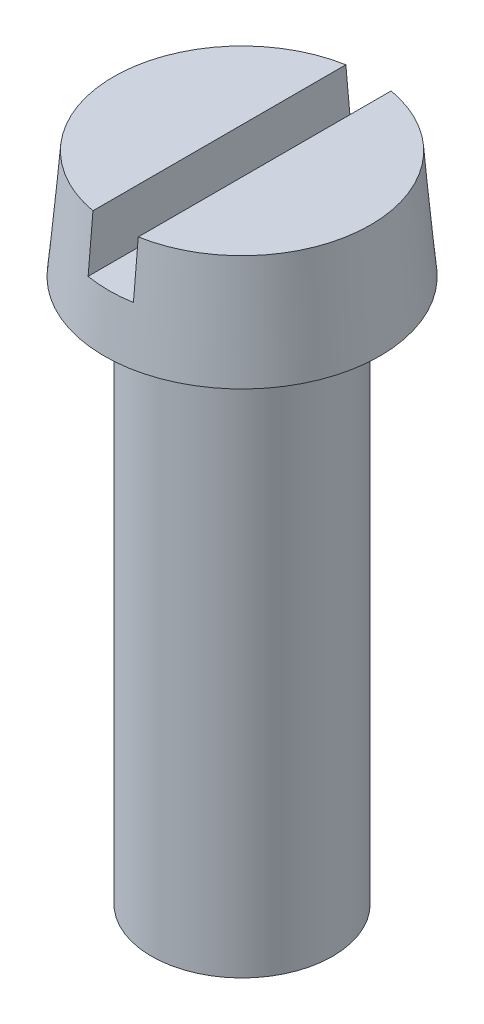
ISO-10303-21;
HEADER;
FILE_DESCRIPTION(('STEP AP214'),'2;1');
FILE_NAME('part.step','',(''),(''),'','','');
FILE_SCHEMA(('AUTOMOTIVE_DESIGN { 1 0 10303 214 1 1 1 1 }'));
ENDSEC;
DATA;
#1=APPLICATION_CONTEXT('core data for automotive mechanical design processes');
#2=APPLICATION_PROTOCOL_DEFINITION('international standard','automotive_design',2000,#1);
#3=PRODUCT_CONTEXT('',#1,'mechanical');
#4=PRODUCT('Part','Part','',(#3));
#5=PRODUCT_RELATED_PRODUCT_CATEGORY('part','',(#4));
#6=PRODUCT_DEFINITION_FORMATION('','',#4);
#7=PRODUCT_DEFINITION_CONTEXT('part definition',#1,'design');
#8=PRODUCT_DEFINITION('design','',#6,#7);
#9=PRODUCT_DEFINITION_SHAPE('','',#8);
#10=(LENGTH_UNIT() NAMED_UNIT(*) SI_UNIT(.MILLI.,.METRE.));
#11=(NAMED_UNIT(*) PLANE_ANGLE_UNIT() SI_UNIT($,.RADIAN.));
#12=(NAMED_UNIT(*) SI_UNIT($,.STERADIAN.) SOLID_ANGLE_UNIT());
#13=UNCERTAINTY_MEASURE_WITH_UNIT(LENGTH_MEASURE(1.E-05),#10,'distance_accuracy_value','');
#14=(GEOMETRIC_REPRESENTATION_CONTEXT(3) GLOBAL_UNCERTAINTY_ASSIGNED_CONTEXT((#13)) GLOBAL_UNIT_ASSIGNED_CONTEXT((#10,
#11,#12)) REPRESENTATION_CONTEXT('',''));
#15=CARTESIAN_POINT('',(0.,0.,0.));
#16=DIRECTION('',(0.,0.,1.));
#17=DIRECTION('',(1.,0.,0.));
#18=AXIS2_PLACEMENT_3D('',#15,#16,#17);
#19=CARTESIAN_POINT('',(0.,108.,0.));
#20=DIRECTION('',(0.,1.,0.));
#21=DIRECTION('',(-1.,0.,0.));
#22=AXIS2_PLACEMENT_3D('',#19,#20,#21);
#23=PLANE('',#22);
#24=DIRECTION('',(0.,0.,1.));
#25=VECTOR('',#24,1.);
#26=CARTESIAN_POINT('',(-3.75,108.,0.));
#27=LINE('',#26,#25);
#28=CARTESIAN_POINT('',(-3.75,108.,-20.9363449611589));
#29=VERTEX_POINT('',#28);
#30=CARTESIAN_POINT('',(-3.75,108.,20.9363449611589));
#31=VERTEX_POINT('',#30);
#32=EDGE_CURVE('E136',#29,#31,#27,.T.);
#33=ORIENTED_EDGE('',*,*,#32,.F.);
#34=CARTESIAN_POINT('',(0.,108.,0.));
#35=DIRECTION('',(0.,-1.,0.));
#36=DIRECTION('',(1.,0.,0.));
#37=AXIS2_PLACEMENT_3D('',#34,#35,#36);
#38=CIRCLE('',#37,21.2695331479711);
#39=EDGE_CURVE('E95',#31,#29,#38,.T.);
#40=ORIENTED_EDGE('',*,*,#39,.F.);
#41=EDGE_LOOP('',(#33,#40));
#42=FACE_BOUND('',#41,.T.);
#43=ADVANCED_FACE('F34',(#42),#23,.T.);
#44=CARTESIAN_POINT('',(15.,90.,0.));
#45=DIRECTION('',(0.,-1.,0.));
#46=DIRECTION('',(1.,0.,0.));
#47=AXIS2_PLACEMENT_3D('',#44,#45,#46);
#48=PLANE('',#47);
#49=CARTESIAN_POINT('',(0.,90.,0.));
#50=DIRECTION('',(0.,-1.,0.));
#51=DIRECTION('',(1.,0.,0.));
#52=AXIS2_PLACEMENT_3D('',#49,#50,#51);
#53=CIRCLE('',#52,22.8443290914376);
#54=CARTESIAN_POINT('',(22.8443290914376,90.,0.));
#55=VERTEX_POINT('',#54);
#56=EDGE_CURVE('E104',#55,#55,#53,.T.);
#57=ORIENTED_EDGE('',*,*,#56,.T.);
#58=EDGE_LOOP('',(#57));
#59=FACE_BOUND('',#58,.T.);
#60=CARTESIAN_POINT('',(0.,90.,0.));
#61=DIRECTION('',(0.,-1.,0.));
#62=DIRECTION('',(1.,0.,0.));
#63=AXIS2_PLACEMENT_3D('',#60,#61,#62);
#64=CIRCLE('',#63,15.);
#65=CARTESIAN_POINT('',(15.,90.,0.));
#66=VERTEX_POINT('',#65);
#67=EDGE_CURVE('E101',#66,#66,#64,.T.);
#68=ORIENTED_EDGE('',*,*,#67,.F.);
#69=EDGE_LOOP('',(#68));
#70=FACE_BOUND('',#69,.T.);
#71=ADVANCED_FACE('F36',(#59,#70),#48,.T.);
#72=CARTESIAN_POINT('',(0.,0.,0.));
#73=DIRECTION('',(0.,-1.,0.));
#74=DIRECTION('',(1.,0.,0.));
#75=AXIS2_PLACEMENT_3D('',#72,#73,#74);
#76=CYLINDRICAL_SURFACE('',#75,15.);
#77=ORIENTED_EDGE('',*,*,#67,.T.);
#78=EDGE_LOOP('',(#77));
#79=FACE_BOUND('',#78,.T.);
#80=CARTESIAN_POINT('',(0.,0.,0.));
#81=DIRECTION('',(0.,-1.,0.));
#82=DIRECTION('',(1.,0.,0.));
#83=AXIS2_PLACEMENT_3D('',#80,#81,#82);
#84=CIRCLE('',#83,15.);
#85=CARTESIAN_POINT('',(15.,0.,0.));
#86=VERTEX_POINT('',#85);
#87=EDGE_CURVE('E97',#86,#86,#84,.T.);
#88=ORIENTED_EDGE('',*,*,#87,.F.);
#89=EDGE_LOOP('',(#88));
#90=FACE_BOUND('',#89,.T.);
#91=ADVANCED_FACE('F153',(#79,#90),#76,.T.);
#92=CARTESIAN_POINT('',(0.,0.,0.));
#93=DIRECTION('',(0.,-1.,0.));
#94=DIRECTION('',(1.,0.,0.));
#95=AXIS2_PLACEMENT_3D('',#92,#93,#94);
#96=PLANE('',#95);
#97=ORIENTED_EDGE('',*,*,#87,.T.);
#98=EDGE_LOOP('',(#97));
#99=FACE_BOUND('',#98,.T.);
#100=ADVANCED_FACE('F148',(#99),#96,.T.);
#101=DIRECTION('',(0.,0.,-1.));
#102=VECTOR('',#101,1.);
#103=CARTESIAN_POINT('',(3.75,108.,0.));
#104=LINE('',#103,#102);
#105=CARTESIAN_POINT('',(3.75,108.,20.9363449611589));
#106=VERTEX_POINT('',#105);
#107=CARTESIAN_POINT('',(3.75,108.,-20.9363449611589));
#108=VERTEX_POINT('',#107);
#109=EDGE_CURVE('E89',#106,#108,#104,.T.);
#110=ORIENTED_EDGE('',*,*,#109,.F.);
#111=EDGE_CURVE('E98',#108,#106,#38,.T.);
#112=ORIENTED_EDGE('',*,*,#111,.F.);
#113=EDGE_LOOP('',(#110,#112));
#114=FACE_BOUND('',#113,.T.);
#115=ADVANCED_FACE('F135',(#114),#23,.T.);
#116=CARTESIAN_POINT('',(0.,90.,0.));
#117=DIRECTION('',(0.,-1.,0.));
#118=DIRECTION('',(1.,0.,0.));
#119=AXIS2_PLACEMENT_3D('',#116,#117,#118);
#120=CONICAL_SURFACE('',#119,22.8443290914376,0.0872664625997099);
#121=CARTESIAN_POINT('',(-3.75,64.235808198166,-24.8166753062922));
#122=CARTESIAN_POINT('',(-3.75,70.8421562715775,-24.2321214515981));
#123=CARTESIAN_POINT('',(-3.75,77.448465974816,-23.647133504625));
#124=CARTESIAN_POINT('',(-3.75,90.6609833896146,-22.4760108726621));
#125=CARTESIAN_POINT('',(-3.75,97.2671911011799,-21.8898761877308));
#126=CARTESIAN_POINT('',(-3.75,110.479480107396,-20.7161814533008));
#127=CARTESIAN_POINT('',(-3.75,117.085561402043,-20.1286214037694));
#128=CARTESIAN_POINT('',(-3.75,130.297555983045,-18.9516118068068));
#129=CARTESIAN_POINT('',(-3.75,136.90346926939,-18.3621622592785));
#130=CARTESIAN_POINT('',(-3.75,143.509277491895,-17.7715359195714));
#131=B_SPLINE_CURVE_WITH_KNOTS('',3,(#121,#122,#123,#124,#125,#126,#127,#128,#129,#130),
.UNSPECIFIED.,.F.,.F.,(4,2,2,2,4),(0.,19.8964781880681,39.7929553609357,59.6894329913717,
79.5859116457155),.UNSPECIFIED.);
#132=CARTESIAN_POINT('',(-3.75,99.,-21.7358163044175));
#133=VERTEX_POINT('',#132);
#134=EDGE_CURVE('E13',#133,#29,#131,.T.);
#135=ORIENTED_EDGE('',*,*,#134,.F.);
#136=CARTESIAN_POINT('',(0.,99.,0.));
#137=DIRECTION('',(0.,1.,0.));
#138=DIRECTION('',(-1.,0.,0.));
#139=AXIS2_PLACEMENT_3D('',#136,#137,#138);
#140=CIRCLE('',#139,22.0569311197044);
#141=CARTESIAN_POINT('',(3.75,99.,-21.7358163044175));
#142=VERTEX_POINT('',#141);
#143=EDGE_CURVE('E77',#133,#142,#140,.F.);
#144=ORIENTED_EDGE('',*,*,#143,.T.);
#145=CARTESIAN_POINT('',(3.75,143.509277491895,-17.7715359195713));
#146=CARTESIAN_POINT('',(3.75,137.962477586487,-18.2674857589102));
#147=CARTESIAN_POINT('',(3.75,132.415602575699,-18.7625947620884));
#148=CARTESIAN_POINT('',(3.75,121.321728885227,-19.7514240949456));
#149=CARTESIAN_POINT('',(3.75,115.774730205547,-20.2451444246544));
#150=CARTESIAN_POINT('',(3.75,108.10957398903,-20.9266320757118));
#151=CARTESIAN_POINT('',(3.75,105.991458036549,-21.1148673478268));
#152=CARTESIAN_POINT('',(3.75,97.267191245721,-21.889879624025));
#153=CARTESIAN_POINT('',(3.75,90.6609831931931,-22.4760126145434));
#154=CARTESIAN_POINT('',(3.75,77.4484654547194,-23.6471318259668));
#155=CARTESIAN_POINT('',(3.75,70.8421557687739,-24.2321180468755));
#156=CARTESIAN_POINT('',(3.75,64.235808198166,-24.8166753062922));
#157=B_SPLINE_CURVE_WITH_KNOTS('',3,(#145,#146,#147,#148,#149,#150,#151,#152,#153,#154,#155,
#156),.UNSPECIFIED.,.F.,.F.,(4,2,2,2,2,4),(0.,16.7067828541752,33.4135653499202,
39.7929563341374,59.6894340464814,79.5859116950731),.UNSPECIFIED.);
#158=EDGE_CURVE('E47',#108,#142,#157,.T.);
#159=ORIENTED_EDGE('',*,*,#158,.F.);
#160=ORIENTED_EDGE('',*,*,#111,.T.);
#161=CARTESIAN_POINT('',(3.75,64.235808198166,24.8166753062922));
#162=CARTESIAN_POINT('',(3.75,70.8421562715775,24.2321214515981));
#163=CARTESIAN_POINT('',(3.75,77.448465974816,23.647133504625));
#164=CARTESIAN_POINT('',(3.75,90.6609833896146,22.4760108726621));
#165=CARTESIAN_POINT('',(3.75,97.2671911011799,21.8898761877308));
#166=CARTESIAN_POINT('',(3.75,110.479480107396,20.7161814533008));
#167=CARTESIAN_POINT('',(3.75,117.085561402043,20.1286214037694));
#168=CARTESIAN_POINT('',(3.75,130.297555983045,18.9516118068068));
#169=CARTESIAN_POINT('',(3.75,136.90346926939,18.3621622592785));
#170=CARTESIAN_POINT('',(3.75,143.509277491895,17.7715359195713));
#171=B_SPLINE_CURVE_WITH_KNOTS('',3,(#161,#162,#163,#164,#165,#166,#167,#168,#169,#170),
.UNSPECIFIED.,.F.,.F.,(4,2,2,2,4),(0.,19.8964781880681,39.7929553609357,59.6894329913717,
79.5859116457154),.UNSPECIFIED.);
#172=CARTESIAN_POINT('',(3.75,99.,21.7358163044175));
#173=VERTEX_POINT('',#172);
#174=EDGE_CURVE('E110',#173,#106,#171,.T.);
#175=ORIENTED_EDGE('',*,*,#174,.F.);
#176=CARTESIAN_POINT('',(-3.75,99.,21.7358163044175));
#177=VERTEX_POINT('',#176);
#178=EDGE_CURVE('E85',#173,#177,#140,.F.);
#179=ORIENTED_EDGE('',*,*,#178,.T.);
#180=CARTESIAN_POINT('',(-3.75,143.509277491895,17.7715359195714));
#181=CARTESIAN_POINT('',(-3.75,137.962477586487,18.2674857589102));
#182=CARTESIAN_POINT('',(-3.75,132.415602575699,18.7625947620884));
#183=CARTESIAN_POINT('',(-3.75,121.321728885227,19.7514240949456));
#184=CARTESIAN_POINT('',(-3.75,115.774730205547,20.2451444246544));
#185=CARTESIAN_POINT('',(-3.75,108.10957398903,20.9266320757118));
#186=CARTESIAN_POINT('',(-3.75,105.991458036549,21.1148673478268));
#187=CARTESIAN_POINT('',(-3.75,97.267191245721,21.889879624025));
#188=CARTESIAN_POINT('',(-3.75,90.6609831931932,22.4760126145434));
#189=CARTESIAN_POINT('',(-3.75,77.4484654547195,23.6471318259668));
#190=CARTESIAN_POINT('',(-3.75,70.8421557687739,24.2321180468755));
#191=CARTESIAN_POINT('',(-3.75,64.235808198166,24.8166753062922));
#192=B_SPLINE_CURVE_WITH_KNOTS('',3,(#180,#181,#182,#183,#184,#185,#186,#187,#188,#189,#190,
#191),.UNSPECIFIED.,.F.,.F.,(4,2,2,2,2,4),(0.,16.7067828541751,33.4135653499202,
39.7929563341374,59.6894340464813,79.5859116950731),.UNSPECIFIED.);
#193=EDGE_CURVE('E83',#31,#177,#192,.T.);
#194=ORIENTED_EDGE('',*,*,#193,.F.);
#195=ORIENTED_EDGE('',*,*,#39,.T.);
#196=EDGE_LOOP('',(#135,#144,#159,#160,#175,#179,#194,#195));
#197=FACE_BOUND('',#196,.T.);
#198=ORIENTED_EDGE('',*,*,#56,.F.);
#199=EDGE_LOOP('',(#198));
#200=FACE_BOUND('',#199,.T.);
#201=ADVANCED_FACE('F92',(#197,#200),#120,.T.);
#202=CARTESIAN_POINT('',(-3.75,37.6933325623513,25.8830903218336));
#203=DIRECTION('',(-1.,0.,0.));
#204=DIRECTION('',(0.,0.,1.));
#205=AXIS2_PLACEMENT_3D('',#202,#203,#204);
#206=PLANE('',#205);
#207=ORIENTED_EDGE('',*,*,#134,.T.);
#208=ORIENTED_EDGE('',*,*,#32,.T.);
#209=ORIENTED_EDGE('',*,*,#193,.T.);
#210=DIRECTION('',(0.,0.,-1.));
#211=VECTOR('',#210,1.);
#212=CARTESIAN_POINT('',(-3.75,99.,25.8830903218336));
#213=LINE('',#212,#211);
#214=EDGE_CURVE('E54',#177,#133,#213,.T.);
#215=ORIENTED_EDGE('',*,*,#214,.T.);
#216=EDGE_LOOP('',(#207,#208,#209,#215));
#217=FACE_BOUND('',#216,.T.);
#218=ADVANCED_FACE('F86',(#217),#206,.F.);
#219=CARTESIAN_POINT('',(3.75,37.6933325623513,25.8830903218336));
#220=DIRECTION('',(1.,0.,0.));
#221=DIRECTION('',(0.,0.,-1.));
#222=AXIS2_PLACEMENT_3D('',#219,#220,#221);
#223=PLANE('',#222);
#224=ORIENTED_EDGE('',*,*,#158,.T.);
#225=DIRECTION('',(0.,0.,1.));
#226=VECTOR('',#225,1.);
#227=CARTESIAN_POINT('',(3.75,99.,25.8830903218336));
#228=LINE('',#227,#226);
#229=EDGE_CURVE('E80',#142,#173,#228,.T.);
#230=ORIENTED_EDGE('',*,*,#229,.T.);
#231=ORIENTED_EDGE('',*,*,#174,.T.);
#232=ORIENTED_EDGE('',*,*,#109,.T.);
#233=EDGE_LOOP('',(#224,#230,#231,#232));
#234=FACE_BOUND('',#233,.T.);
#235=ADVANCED_FACE('F121',(#234),#223,.F.);
#236=CARTESIAN_POINT('',(0.,99.,0.));
#237=DIRECTION('',(0.,1.,0.));
#238=DIRECTION('',(-1.,0.,0.));
#239=AXIS2_PLACEMENT_3D('',#236,#237,#238);
#240=PLANE('',#239);
#241=ORIENTED_EDGE('',*,*,#214,.F.);
#242=ORIENTED_EDGE('',*,*,#178,.F.);
#243=ORIENTED_EDGE('',*,*,#229,.F.);
#244=ORIENTED_EDGE('',*,*,#143,.F.);
#245=EDGE_LOOP('',(#241,#242,#243,#244));
#246=FACE_BOUND('',#245,.T.);
#247=ADVANCED_FACE('F78',(#246),#240,.T.);
#248=CLOSED_SHELL('',(#43,#71,#91,#100,#115,#201,#218,#235,#247));
#249=MANIFOLD_SOLID_BREP('B2',#248);
#250=ADVANCED_BREP_SHAPE_REPRESENTATION('',(#18,#249),#14);
#251=SHAPE_DEFINITION_REPRESENTATION(#9,#250);
ENDSEC;
END-ISO-10303-21;
